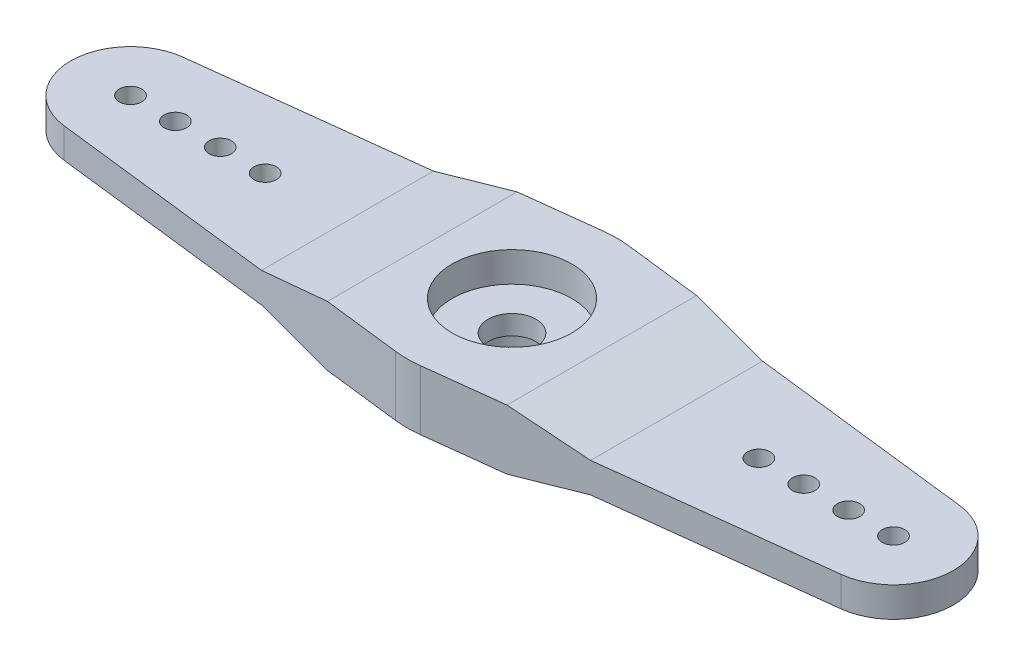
from build123d import *

# Parameters (mm, degrees)
EXTRUSION6_DEPTH        = 30
ESQUISSE8_W             = 60
ESQUISSE8_H             = 30
ENL_V_MAT_EXTRU_4_DEPTH = 43.614551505
ESQUISSE9_R             = 4
ENL_V_MAT_EXTRU_5_DEPTH = 2
ESQUISSE10_R            = 5
EXTRUSION7_DEPTH        = 0.5
ESQUISSE11_R            = 5
EXTRUSION8_DEPTH        = 1.5
EXTRUSION8_TAPER        = 45
ESQUISSE12_R            = 0.75
ENL_V_MAT_EXTRU_6_DEPTH = 38.138255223
ESQUISSE13_R            = 2.9
EXTRUSION9_DEPTH        = 2.7
ESQUISSE14_R            = 1.6
ENL_V_MAT_EXTRU_7_DEPTH = 38.016888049


with BuildPart() as part:
    # Esquisse1 → Extrusion6 (new body)
    with BuildSketch(Plane.XY):
        Polygon((-30, 3), (-11, 3), (-6, 4), (6, 4), (11, 3), (30, 3), (30, 1), (11, 1), (6, 0), (-6, 0), (-11, 1), (-30, 1), align=None)
    extrude(amount=EXTRUSION6_DEPTH)

    # Esquisse8 → Enl_v. mat.-Extru.4 (cut, through all)
    with BuildSketch(Plane(origin=(0, 4, 0), x_dir=(1, 0, 0), z_dir=(0, 1, 0))):
        with Locations((0, -15)):
            Rectangle(ESQUISSE8_W, ESQUISSE8_H)
        with BuildLine():
            Line((-25.970588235, -11.027778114), (-0.823529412, -8.048611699))
            ThreePointArc((-0.823529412, -8.048611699), (0, -8), (0.823529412, -8.048611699))
            Line((0.823529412, -8.048611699), (25.970588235, -11.027778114))
            ThreePointArc((25.970588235, -11.027778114), (29.5, -15), (25.970588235, -18.972221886))
            Line((25.970588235, -18.972221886), (0.823529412, -21.951388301))
            ThreePointArc((0.823529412, -21.951388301), (0, -22), (-0.823529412, -21.951388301))
            Line((-0.823529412, -21.951388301), (-25.970588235, -18.972221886))
            ThreePointArc((-25.970588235, -18.972221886), (-29.5, -15), (-25.970588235, -11.027778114))
        make_face(mode=Mode.SUBTRACT)
    extrude(amount=-ENL_V_MAT_EXTRU_4_DEPTH, mode=Mode.SUBTRACT)

    # Esquisse9 → Enl_v. mat.-Extru.5 (cut)
    with BuildSketch(Plane(origin=(0, 4, 0), x_dir=(1, 0, 0), z_dir=(0, 1, 0))):
        with Locations(Location((0, -15, 0), (0, 0, 270))):
            Circle(ESQUISSE9_R)
    extrude(amount=-ENL_V_MAT_EXTRU_5_DEPTH, mode=Mode.SUBTRACT)

    # Esquisse10 → Extrusion7 (add)
    with BuildSketch(Plane.XZ):
        with Locations(Location((0, 15, 0), (0, 0, 90))):
            Circle(ESQUISSE10_R)
    extrude(amount=EXTRUSION7_DEPTH)

    # Esquisse11 → Extrusion8 (add)
    with BuildSketch(Plane.XZ.offset(0.5)):
        with Locations(Location((0, 15, 0), (0, 0, 90))):
            Circle(ESQUISSE11_R)
    extrude(amount=EXTRUSION8_DEPTH, taper=EXTRUSION8_TAPER)

    # Esquisse12 → Enl_v. mat.-Extru.6 (cut, through all)
    with BuildSketch(Plane(origin=(0, 3, 0), x_dir=(1, 0, 0), z_dir=(0, 1, 0))):
        with Locations(Location((-16.5, -15, 0), (0, 0, 270))):
            Circle(ESQUISSE12_R)
        with Locations(Location((-19.5, -15, 0), (0, 0, 270))):
            Circle(ESQUISSE12_R)
        with Locations(Location((-22.5, -15, 0), (0, 0, 270))):
            Circle(ESQUISSE12_R)
        with Locations(Location((-25.5, -15, 0), (0, 0, 270))):
            Circle(ESQUISSE12_R)
        with Locations(Location((16.5, -15, 0), (0, 0, 270))):
            Circle(ESQUISSE12_R)
        with Locations(Location((19.5, -15, 0), (0, 0, 270))):
            Circle(ESQUISSE12_R)
        with Locations(Location((22.5, -15, 0), (0, 0, 270))):
            Circle(ESQUISSE12_R)
        with Locations(Location((25.5, -15, 0), (0, 0, 270))):
            Circle(ESQUISSE12_R)
    extrude(amount=-ENL_V_MAT_EXTRU_6_DEPTH, mode=Mode.SUBTRACT)

    # Esquisse13 → Extrusion9 (cut)
    with BuildSketch(Plane.XZ.offset(2)):
        with Locations(Location((0, 15, 0), (0, 0, 270))):
            Circle(ESQUISSE13_R)
    extrude(amount=-EXTRUSION9_DEPTH, mode=Mode.SUBTRACT)

    # Esquisse14 → Enl_v. mat.-Extru.7 (cut, through all)
    with BuildSketch(Plane(origin=(0, 2, 0), x_dir=(1, 0, 0), z_dir=(0, 1, 0))):
        with Locations(Location((0, -15, 0), (0, 0, 270))):
            Circle(ESQUISSE14_R)
    extrude(amount=-ENL_V_MAT_EXTRU_7_DEPTH, mode=Mode.SUBTRACT)


solid = part.part
